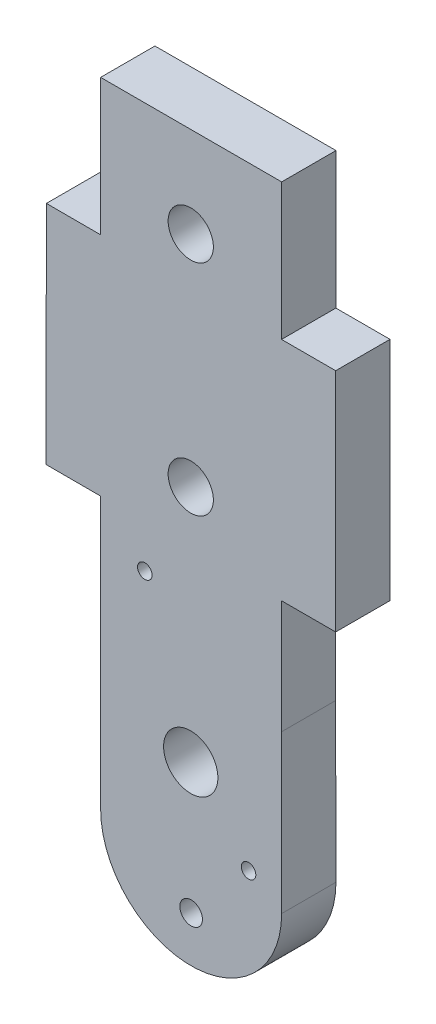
ISO-10303-21;
HEADER;
FILE_DESCRIPTION(('STEP AP214'),'2;1');
FILE_NAME('part.step','',(''),(''),'','','');
FILE_SCHEMA(('AUTOMOTIVE_DESIGN { 1 0 10303 214 1 1 1 1 }'));
ENDSEC;
DATA;
#1=APPLICATION_CONTEXT('core data for automotive mechanical design processes');
#2=APPLICATION_PROTOCOL_DEFINITION('international standard','automotive_design',2000,#1);
#3=PRODUCT_CONTEXT('',#1,'mechanical');
#4=PRODUCT('Part','Part','',(#3));
#5=PRODUCT_RELATED_PRODUCT_CATEGORY('part','',(#4));
#6=PRODUCT_DEFINITION_FORMATION('','',#4);
#7=PRODUCT_DEFINITION_CONTEXT('part definition',#1,'design');
#8=PRODUCT_DEFINITION('design','',#6,#7);
#9=PRODUCT_DEFINITION_SHAPE('','',#8);
#10=(LENGTH_UNIT() NAMED_UNIT(*) SI_UNIT(.MILLI.,.METRE.));
#11=(NAMED_UNIT(*) PLANE_ANGLE_UNIT() SI_UNIT($,.RADIAN.));
#12=(NAMED_UNIT(*) SI_UNIT($,.STERADIAN.) SOLID_ANGLE_UNIT());
#13=UNCERTAINTY_MEASURE_WITH_UNIT(LENGTH_MEASURE(1.E-05),#10,'distance_accuracy_value','');
#14=(GEOMETRIC_REPRESENTATION_CONTEXT(3) GLOBAL_UNCERTAINTY_ASSIGNED_CONTEXT((#13)) GLOBAL_UNIT_ASSIGNED_CONTEXT((#10,
#11,#12)) REPRESENTATION_CONTEXT('',''));
#15=CARTESIAN_POINT('',(0.,0.,0.));
#16=DIRECTION('',(0.,0.,1.));
#17=DIRECTION('',(1.,0.,0.));
#18=AXIS2_PLACEMENT_3D('',#15,#16,#17);
#19=CARTESIAN_POINT('',(217.342156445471,-312.606770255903,6.));
#20=DIRECTION('',(1.,0.,0.));
#21=DIRECTION('',(0.,1.,0.));
#22=AXIS2_PLACEMENT_3D('',#19,#20,#21);
#23=PLANE('',#22);
#24=DIRECTION('',(0.,-1.,0.));
#25=VECTOR('',#24,1.);
#26=CARTESIAN_POINT('',(217.342156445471,-312.606770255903,0.));
#27=LINE('',#26,#25);
#28=CARTESIAN_POINT('',(217.342156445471,-242.033196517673,0.));
#29=VERTEX_POINT('',#28);
#30=CARTESIAN_POINT('',(217.342156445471,-271.971337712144,0.));
#31=VERTEX_POINT('',#30);
#32=EDGE_CURVE('E183',#29,#31,#27,.T.);
#33=ORIENTED_EDGE('',*,*,#32,.T.);
#34=DIRECTION('',(0.,0.,-1.));
#35=VECTOR('',#34,1.);
#36=CARTESIAN_POINT('',(217.342156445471,-271.971337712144,6.));
#37=LINE('',#36,#35);
#38=CARTESIAN_POINT('',(217.342156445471,-271.971337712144,6.));
#39=VERTEX_POINT('',#38);
#40=EDGE_CURVE('E11',#39,#31,#37,.T.);
#41=ORIENTED_EDGE('',*,*,#40,.F.);
#42=DIRECTION('',(0.,-1.,0.));
#43=VECTOR('',#42,1.);
#44=CARTESIAN_POINT('',(217.342156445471,-312.606770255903,6.));
#45=LINE('',#44,#43);
#46=CARTESIAN_POINT('',(217.342156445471,-242.033196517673,6.));
#47=VERTEX_POINT('',#46);
#48=EDGE_CURVE('E268',#47,#39,#45,.T.);
#49=ORIENTED_EDGE('',*,*,#48,.F.);
#50=DIRECTION('',(0.,0.,-1.));
#51=VECTOR('',#50,1.);
#52=CARTESIAN_POINT('',(217.342156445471,-242.033196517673,6.));
#53=LINE('',#52,#51);
#54=EDGE_CURVE('E169',#47,#29,#53,.T.);
#55=ORIENTED_EDGE('',*,*,#54,.T.);
#56=EDGE_LOOP('',(#33,#41,#49,#55));
#57=FACE_BOUND('',#56,.T.);
#58=ADVANCED_FACE('F34',(#57),#23,.F.);
#59=CARTESIAN_POINT('',(227.342156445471,-271.971337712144,6.));
#60=DIRECTION('',(0.,0.,-1.));
#61=DIRECTION('',(-1.,0.,0.));
#62=AXIS2_PLACEMENT_3D('',#59,#60,#61);
#63=CYLINDRICAL_SURFACE('',#62,10.);
#64=CARTESIAN_POINT('',(227.342156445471,-271.971337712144,0.));
#65=DIRECTION('',(0.,0.,1.));
#66=DIRECTION('',(1.,0.,0.));
#67=AXIS2_PLACEMENT_3D('',#64,#65,#66);
#68=CIRCLE('',#67,10.);
#69=CARTESIAN_POINT('',(237.342156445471,-271.971337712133,0.));
#70=VERTEX_POINT('',#69);
#71=EDGE_CURVE('E186',#31,#70,#68,.T.);
#72=ORIENTED_EDGE('',*,*,#71,.T.);
#73=DIRECTION('',(0.,0.,-1.));
#74=VECTOR('',#73,1.);
#75=CARTESIAN_POINT('',(237.342156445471,-271.971337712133,6.));
#76=LINE('',#75,#74);
#77=CARTESIAN_POINT('',(237.342156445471,-271.971337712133,6.));
#78=VERTEX_POINT('',#77);
#79=EDGE_CURVE('E43',#78,#70,#76,.T.);
#80=ORIENTED_EDGE('',*,*,#79,.F.);
#81=CARTESIAN_POINT('',(227.342156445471,-271.971337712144,6.));
#82=DIRECTION('',(0.,0.,1.));
#83=DIRECTION('',(1.,0.,0.));
#84=AXIS2_PLACEMENT_3D('',#81,#82,#83);
#85=CIRCLE('',#84,10.);
#86=EDGE_CURVE('E111',#39,#78,#85,.T.);
#87=ORIENTED_EDGE('',*,*,#86,.F.);
#88=ORIENTED_EDGE('',*,*,#40,.T.);
#89=EDGE_LOOP('',(#72,#80,#87,#88));
#90=FACE_BOUND('',#89,.T.);
#91=ADVANCED_FACE('F250',(#90),#63,.T.);
#92=CARTESIAN_POINT('',(237.444826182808,-312.581228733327,6.));
#93=DIRECTION('',(0.999996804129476,0.00252818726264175,0.));
#94=DIRECTION('',(-0.00252818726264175,0.999996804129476,0.));
#95=AXIS2_PLACEMENT_3D('',#92,#93,#94);
#96=PLANE('',#95);
#97=DIRECTION('',(0.00252818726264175,-0.999996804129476,0.));
#98=VECTOR('',#97,1.);
#99=CARTESIAN_POINT('',(237.444826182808,-312.581228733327,0.));
#100=LINE('',#99,#98);
#101=CARTESIAN_POINT('',(237.298280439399,-254.616663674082,0.));
#102=VERTEX_POINT('',#101);
#103=EDGE_CURVE('E189',#102,#70,#100,.T.);
#104=ORIENTED_EDGE('',*,*,#103,.F.);
#105=DIRECTION('',(0.,0.,-1.));
#106=VECTOR('',#105,1.);
#107=CARTESIAN_POINT('',(237.298280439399,-254.616663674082,6.));
#108=LINE('',#107,#106);
#109=CARTESIAN_POINT('',(237.298280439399,-254.616663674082,6.));
#110=VERTEX_POINT('',#109);
#111=EDGE_CURVE('E243',#110,#102,#108,.T.);
#112=ORIENTED_EDGE('',*,*,#111,.F.);
#113=DIRECTION('',(0.00252818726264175,-0.999996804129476,0.));
#114=VECTOR('',#113,1.);
#115=CARTESIAN_POINT('',(237.444826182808,-312.581228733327,6.));
#116=LINE('',#115,#114);
#117=EDGE_CURVE('E249',#110,#78,#116,.T.);
#118=ORIENTED_EDGE('',*,*,#117,.T.);
#119=ORIENTED_EDGE('',*,*,#79,.T.);
#120=EDGE_LOOP('',(#104,#112,#118,#119));
#121=FACE_BOUND('',#120,.T.);
#122=ADVANCED_FACE('F247',(#121),#96,.T.);
#123=CARTESIAN_POINT('',(237.249943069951,-312.615027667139,6.));
#124=DIRECTION('',(0.999999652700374,-0.000833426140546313,0.));
#125=DIRECTION('',(0.000833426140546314,0.999999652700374,0.));
#126=AXIS2_PLACEMENT_3D('',#123,#124,#125);
#127=PLANE('',#126);
#128=DIRECTION('',(-0.000833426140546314,-0.999999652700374,0.));
#129=VECTOR('',#128,1.);
#130=CARTESIAN_POINT('',(237.249943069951,-312.615027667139,0.));
#131=LINE('',#130,#129);
#132=CARTESIAN_POINT('',(237.308753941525,-242.049865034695,0.));
#133=VERTEX_POINT('',#132);
#134=EDGE_CURVE('E192',#133,#102,#131,.T.);
#135=ORIENTED_EDGE('',*,*,#134,.F.);
#136=DIRECTION('',(0.,0.,-1.));
#137=VECTOR('',#136,1.);
#138=CARTESIAN_POINT('',(237.308753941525,-242.049865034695,6.));
#139=LINE('',#138,#137);
#140=CARTESIAN_POINT('',(237.308753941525,-242.049865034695,6.));
#141=VERTEX_POINT('',#140);
#142=EDGE_CURVE('E241',#141,#133,#139,.T.);
#143=ORIENTED_EDGE('',*,*,#142,.F.);
#144=DIRECTION('',(-0.000833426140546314,-0.999999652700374,0.));
#145=VECTOR('',#144,1.);
#146=CARTESIAN_POINT('',(237.249943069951,-312.615027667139,6.));
#147=LINE('',#146,#145);
#148=EDGE_CURVE('E264',#141,#110,#147,.T.);
#149=ORIENTED_EDGE('',*,*,#148,.T.);
#150=ORIENTED_EDGE('',*,*,#111,.T.);
#151=EDGE_LOOP('',(#135,#143,#149,#150));
#152=FACE_BOUND('',#151,.T.);
#153=ADVANCED_FACE('F260',(#152),#127,.T.);
#154=CARTESIAN_POINT('',(227.342156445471,-242.049865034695,6.));
#155=DIRECTION('',(0.,1.,0.));
#156=DIRECTION('',(0.,0.,1.));
#157=AXIS2_PLACEMENT_3D('',#154,#155,#156);
#158=PLANE('',#157);
#159=DIRECTION('',(1.,0.,0.));
#160=VECTOR('',#159,1.);
#161=CARTESIAN_POINT('',(227.342156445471,-242.049865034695,0.));
#162=LINE('',#161,#160);
#163=CARTESIAN_POINT('',(243.308753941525,-242.049865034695,0.));
#164=VERTEX_POINT('',#163);
#165=EDGE_CURVE('E195',#133,#164,#162,.T.);
#166=ORIENTED_EDGE('',*,*,#165,.T.);
#167=DIRECTION('',(0.,0.,-1.));
#168=VECTOR('',#167,1.);
#169=CARTESIAN_POINT('',(243.308753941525,-242.049865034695,6.));
#170=LINE('',#169,#168);
#171=CARTESIAN_POINT('',(243.308753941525,-242.049865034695,6.));
#172=VERTEX_POINT('',#171);
#173=EDGE_CURVE('E238',#172,#164,#170,.T.);
#174=ORIENTED_EDGE('',*,*,#173,.F.);
#175=DIRECTION('',(1.,0.,0.));
#176=VECTOR('',#175,1.);
#177=CARTESIAN_POINT('',(227.342156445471,-242.049865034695,6.));
#178=LINE('',#177,#176);
#179=EDGE_CURVE('E266',#141,#172,#178,.T.);
#180=ORIENTED_EDGE('',*,*,#179,.F.);
#181=ORIENTED_EDGE('',*,*,#142,.T.);
#182=EDGE_LOOP('',(#166,#174,#180,#181));
#183=FACE_BOUND('',#182,.T.);
#184=ADVANCED_FACE('F506',(#183),#158,.F.);
#185=CARTESIAN_POINT('',(243.308753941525,-312.606770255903,6.));
#186=DIRECTION('',(-1.,0.,0.));
#187=DIRECTION('',(0.,0.,1.));
#188=AXIS2_PLACEMENT_3D('',#185,#186,#187);
#189=PLANE('',#188);
#190=DIRECTION('',(0.,1.,0.));
#191=VECTOR('',#190,1.);
#192=CARTESIAN_POINT('',(243.308753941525,-312.606770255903,0.));
#193=LINE('',#192,#191);
#194=CARTESIAN_POINT('',(243.308753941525,-217.049865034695,0.));
#195=VERTEX_POINT('',#194);
#196=EDGE_CURVE('E197',#164,#195,#193,.T.);
#197=ORIENTED_EDGE('',*,*,#196,.T.);
#198=DIRECTION('',(0.,0.,-1.));
#199=VECTOR('',#198,1.);
#200=CARTESIAN_POINT('',(243.308753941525,-217.049865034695,6.));
#201=LINE('',#200,#199);
#202=CARTESIAN_POINT('',(243.308753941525,-217.049865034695,6.));
#203=VERTEX_POINT('',#202);
#204=EDGE_CURVE('E235',#203,#195,#201,.T.);
#205=ORIENTED_EDGE('',*,*,#204,.F.);
#206=DIRECTION('',(0.,1.,0.));
#207=VECTOR('',#206,1.);
#208=CARTESIAN_POINT('',(243.308753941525,-312.606770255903,6.));
#209=LINE('',#208,#207);
#210=EDGE_CURVE('E273',#172,#203,#209,.T.);
#211=ORIENTED_EDGE('',*,*,#210,.F.);
#212=ORIENTED_EDGE('',*,*,#173,.T.);
#213=EDGE_LOOP('',(#197,#205,#211,#212));
#214=FACE_BOUND('',#213,.T.);
#215=ADVANCED_FACE('F496',(#214),#189,.F.);
#216=CARTESIAN_POINT('',(227.342156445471,-217.049865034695,6.));
#217=DIRECTION('',(0.,-1.,0.));
#218=DIRECTION('',(0.,0.,-1.));
#219=AXIS2_PLACEMENT_3D('',#216,#217,#218);
#220=PLANE('',#219);
#221=DIRECTION('',(-1.,0.,0.));
#222=VECTOR('',#221,1.);
#223=CARTESIAN_POINT('',(227.342156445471,-217.049865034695,0.));
#224=LINE('',#223,#222);
#225=CARTESIAN_POINT('',(237.329589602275,-217.049865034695,0.));
#226=VERTEX_POINT('',#225);
#227=EDGE_CURVE('E199',#195,#226,#224,.T.);
#228=ORIENTED_EDGE('',*,*,#227,.T.);
#229=DIRECTION('',(0.,0.,-1.));
#230=VECTOR('',#229,1.);
#231=CARTESIAN_POINT('',(237.329589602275,-217.049865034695,6.));
#232=LINE('',#231,#230);
#233=CARTESIAN_POINT('',(237.329589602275,-217.049865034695,6.));
#234=VERTEX_POINT('',#233);
#235=EDGE_CURVE('E233',#234,#226,#232,.T.);
#236=ORIENTED_EDGE('',*,*,#235,.F.);
#237=DIRECTION('',(-1.,0.,0.));
#238=VECTOR('',#237,1.);
#239=CARTESIAN_POINT('',(227.342156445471,-217.049865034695,6.));
#240=LINE('',#239,#238);
#241=EDGE_CURVE('E275',#203,#234,#240,.T.);
#242=ORIENTED_EDGE('',*,*,#241,.F.);
#243=ORIENTED_EDGE('',*,*,#204,.T.);
#244=EDGE_LOOP('',(#228,#236,#242,#243));
#245=FACE_BOUND('',#244,.T.);
#246=ADVANCED_FACE('F486',(#245),#220,.F.);
#247=CARTESIAN_POINT('',(237.249943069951,-312.615027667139,6.));
#248=DIRECTION('',(0.999999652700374,-0.000833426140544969,0.));
#249=DIRECTION('',(0.00083342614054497,0.999999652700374,0.));
#250=AXIS2_PLACEMENT_3D('',#247,#248,#249);
#251=PLANE('',#250);
#252=DIRECTION('',(-0.000833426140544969,-0.999999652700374,0.));
#253=VECTOR('',#252,1.);
#254=CARTESIAN_POINT('',(237.249943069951,-312.615027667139,0.));
#255=LINE('',#254,#253);
#256=CARTESIAN_POINT('',(237.342156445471,-201.971337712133,0.));
#257=VERTEX_POINT('',#256);
#258=EDGE_CURVE('E202',#257,#226,#255,.T.);
#259=ORIENTED_EDGE('',*,*,#258,.F.);
#260=DIRECTION('',(0.,0.,-1.));
#261=VECTOR('',#260,1.);
#262=CARTESIAN_POINT('',(237.342156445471,-201.971337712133,6.));
#263=LINE('',#262,#261);
#264=CARTESIAN_POINT('',(237.342156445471,-201.971337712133,6.));
#265=VERTEX_POINT('',#264);
#266=EDGE_CURVE('E231',#265,#257,#263,.T.);
#267=ORIENTED_EDGE('',*,*,#266,.F.);
#268=DIRECTION('',(-0.000833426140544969,-0.999999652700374,0.));
#269=VECTOR('',#268,1.);
#270=CARTESIAN_POINT('',(237.249943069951,-312.615027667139,6.));
#271=LINE('',#270,#269);
#272=EDGE_CURVE('E277',#265,#234,#271,.T.);
#273=ORIENTED_EDGE('',*,*,#272,.T.);
#274=ORIENTED_EDGE('',*,*,#235,.T.);
#275=EDGE_LOOP('',(#259,#267,#273,#274));
#276=FACE_BOUND('',#275,.T.);
#277=ADVANCED_FACE('F476',(#276),#251,.T.);
#278=CARTESIAN_POINT('',(227.342156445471,-201.971337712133,6.));
#279=DIRECTION('',(0.,1.,0.));
#280=DIRECTION('',(0.,0.,1.));
#281=AXIS2_PLACEMENT_3D('',#278,#279,#280);
#282=PLANE('',#281);
#283=DIRECTION('',(1.,0.,0.));
#284=VECTOR('',#283,1.);
#285=CARTESIAN_POINT('',(227.342156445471,-201.971337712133,0.));
#286=LINE('',#285,#284);
#287=CARTESIAN_POINT('',(217.342156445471,-201.971337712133,0.));
#288=VERTEX_POINT('',#287);
#289=EDGE_CURVE('E205',#288,#257,#286,.T.);
#290=ORIENTED_EDGE('',*,*,#289,.F.);
#291=DIRECTION('',(0.,0.,-1.));
#292=VECTOR('',#291,1.);
#293=CARTESIAN_POINT('',(217.342156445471,-201.971337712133,6.));
#294=LINE('',#293,#292);
#295=CARTESIAN_POINT('',(217.342156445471,-201.971337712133,6.));
#296=VERTEX_POINT('',#295);
#297=EDGE_CURVE('E229',#296,#288,#294,.T.);
#298=ORIENTED_EDGE('',*,*,#297,.F.);
#299=DIRECTION('',(1.,0.,0.));
#300=VECTOR('',#299,1.);
#301=CARTESIAN_POINT('',(227.342156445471,-201.971337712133,6.));
#302=LINE('',#301,#300);
#303=EDGE_CURVE('E280',#296,#265,#302,.T.);
#304=ORIENTED_EDGE('',*,*,#303,.T.);
#305=ORIENTED_EDGE('',*,*,#266,.T.);
#306=EDGE_LOOP('',(#290,#298,#304,#305));
#307=FACE_BOUND('',#306,.T.);
#308=ADVANCED_FACE('F465',(#307),#282,.T.);
#309=CARTESIAN_POINT('',(217.342156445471,-312.606770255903,6.));
#310=DIRECTION('',(-1.,0.,0.));
#311=DIRECTION('',(0.,-1.,0.));
#312=AXIS2_PLACEMENT_3D('',#309,#310,#311);
#313=PLANE('',#312);
#314=DIRECTION('',(0.,1.,0.));
#315=VECTOR('',#314,1.);
#316=CARTESIAN_POINT('',(217.342156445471,-312.606770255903,0.));
#317=LINE('',#316,#315);
#318=CARTESIAN_POINT('',(217.342156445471,-217.033196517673,0.));
#319=VERTEX_POINT('',#318);
#320=EDGE_CURVE('E208',#319,#288,#317,.T.);
#321=ORIENTED_EDGE('',*,*,#320,.F.);
#322=DIRECTION('',(0.,0.,-1.));
#323=VECTOR('',#322,1.);
#324=CARTESIAN_POINT('',(217.342156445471,-217.033196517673,6.));
#325=LINE('',#324,#323);
#326=CARTESIAN_POINT('',(217.342156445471,-217.033196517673,6.));
#327=VERTEX_POINT('',#326);
#328=EDGE_CURVE('E227',#327,#319,#325,.T.);
#329=ORIENTED_EDGE('',*,*,#328,.F.);
#330=DIRECTION('',(0.,1.,0.));
#331=VECTOR('',#330,1.);
#332=CARTESIAN_POINT('',(217.342156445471,-312.606770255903,6.));
#333=LINE('',#332,#331);
#334=EDGE_CURVE('E283',#327,#296,#333,.T.);
#335=ORIENTED_EDGE('',*,*,#334,.T.);
#336=ORIENTED_EDGE('',*,*,#297,.T.);
#337=EDGE_LOOP('',(#321,#329,#335,#336));
#338=FACE_BOUND('',#337,.T.);
#339=ADVANCED_FACE('F455',(#338),#313,.T.);
#340=CARTESIAN_POINT('',(227.342156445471,-217.033196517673,6.));
#341=DIRECTION('',(0.,1.,0.));
#342=DIRECTION('',(0.,0.,1.));
#343=AXIS2_PLACEMENT_3D('',#340,#341,#342);
#344=PLANE('',#343);
#345=DIRECTION('',(1.,0.,0.));
#346=VECTOR('',#345,1.);
#347=CARTESIAN_POINT('',(227.342156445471,-217.033196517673,0.));
#348=LINE('',#347,#346);
#349=CARTESIAN_POINT('',(217.329603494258,-217.033196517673,0.));
#350=VERTEX_POINT('',#349);
#351=EDGE_CURVE('E211',#350,#319,#348,.T.);
#352=ORIENTED_EDGE('',*,*,#351,.F.);
#353=DIRECTION('',(0.,0.,-1.));
#354=VECTOR('',#353,1.);
#355=CARTESIAN_POINT('',(217.329603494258,-217.033196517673,6.));
#356=LINE('',#355,#354);
#357=CARTESIAN_POINT('',(217.329603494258,-217.033196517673,6.));
#358=VERTEX_POINT('',#357);
#359=EDGE_CURVE('E225',#358,#350,#356,.T.);
#360=ORIENTED_EDGE('',*,*,#359,.F.);
#361=DIRECTION('',(1.,0.,0.));
#362=VECTOR('',#361,1.);
#363=CARTESIAN_POINT('',(227.342156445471,-217.033196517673,6.));
#364=LINE('',#363,#362);
#365=EDGE_CURVE('E286',#358,#327,#364,.T.);
#366=ORIENTED_EDGE('',*,*,#365,.T.);
#367=ORIENTED_EDGE('',*,*,#328,.T.);
#368=EDGE_LOOP('',(#352,#360,#366,#367));
#369=FACE_BOUND('',#368,.T.);
#370=ADVANCED_FACE('F446',(#369),#344,.T.);
#371=CARTESIAN_POINT('',(227.50143537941,-217.050151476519,6.));
#372=DIRECTION('',(0.00166685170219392,0.999998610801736,0.));
#373=DIRECTION('',(-0.999998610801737,0.00166685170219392,0.));
#374=AXIS2_PLACEMENT_3D('',#371,#372,#373);
#375=PLANE('',#374);
#376=DIRECTION('',(0.999998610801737,-0.00166685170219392,0.));
#377=VECTOR('',#376,1.);
#378=CARTESIAN_POINT('',(227.50143537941,-217.050151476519,0.));
#379=LINE('',#378,#377);
#380=CARTESIAN_POINT('',(211.350447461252,-217.023230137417,0.));
#381=VERTEX_POINT('',#380);
#382=EDGE_CURVE('E214',#381,#350,#379,.T.);
#383=ORIENTED_EDGE('',*,*,#382,.F.);
#384=DIRECTION('',(0.,0.,-1.));
#385=VECTOR('',#384,1.);
#386=CARTESIAN_POINT('',(211.350447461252,-217.023230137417,6.));
#387=LINE('',#386,#385);
#388=CARTESIAN_POINT('',(211.350447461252,-217.023230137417,6.));
#389=VERTEX_POINT('',#388);
#390=EDGE_CURVE('E157',#389,#381,#387,.T.);
#391=ORIENTED_EDGE('',*,*,#390,.F.);
#392=DIRECTION('',(0.999998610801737,-0.00166685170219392,0.));
#393=VECTOR('',#392,1.);
#394=CARTESIAN_POINT('',(227.50143537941,-217.050151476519,6.));
#395=LINE('',#394,#393);
#396=EDGE_CURVE('E165',#389,#358,#395,.T.);
#397=ORIENTED_EDGE('',*,*,#396,.T.);
#398=ORIENTED_EDGE('',*,*,#359,.T.);
#399=EDGE_LOOP('',(#383,#391,#397,#398));
#400=FACE_BOUND('',#399,.T.);
#401=ADVANCED_FACE('F290',(#400),#375,.T.);
#402=CARTESIAN_POINT('',(211.191168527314,-312.579848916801,6.));
#403=DIRECTION('',(-0.999998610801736,0.00166685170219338,0.));
#404=DIRECTION('',(-0.00166685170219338,-0.999998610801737,0.));
#405=AXIS2_PLACEMENT_3D('',#402,#403,#404);
#406=PLANE('',#405);
#407=DIRECTION('',(0.00166685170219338,0.999998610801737,0.));
#408=VECTOR('',#407,1.);
#409=CARTESIAN_POINT('',(211.191168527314,-312.579848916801,0.));
#410=LINE('',#409,#408);
#411=CARTESIAN_POINT('',(211.308776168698,-242.02319540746,0.));
#412=VERTEX_POINT('',#411);
#413=EDGE_CURVE('E152',#412,#381,#410,.T.);
#414=ORIENTED_EDGE('',*,*,#413,.F.);
#415=DIRECTION('',(0.,0.,-1.));
#416=VECTOR('',#415,1.);
#417=CARTESIAN_POINT('',(211.308776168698,-242.02319540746,6.));
#418=LINE('',#417,#416);
#419=CARTESIAN_POINT('',(211.308776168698,-242.02319540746,6.));
#420=VERTEX_POINT('',#419);
#421=EDGE_CURVE('E147',#420,#412,#418,.T.);
#422=ORIENTED_EDGE('',*,*,#421,.F.);
#423=DIRECTION('',(0.00166685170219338,0.999998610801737,0.));
#424=VECTOR('',#423,1.);
#425=CARTESIAN_POINT('',(211.191168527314,-312.579848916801,6.));
#426=LINE('',#425,#424);
#427=EDGE_CURVE('E150',#420,#389,#426,.T.);
#428=ORIENTED_EDGE('',*,*,#427,.T.);
#429=ORIENTED_EDGE('',*,*,#390,.T.);
#430=EDGE_LOOP('',(#414,#422,#428,#429));
#431=FACE_BOUND('',#430,.T.);
#432=ADVANCED_FACE('F149',(#431),#406,.T.);
#433=CARTESIAN_POINT('',(227.459764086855,-242.050116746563,6.));
#434=DIRECTION('',(-0.00166685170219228,-0.999998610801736,0.));
#435=DIRECTION('',(0.999998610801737,-0.00166685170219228,0.));
#436=AXIS2_PLACEMENT_3D('',#433,#434,#435);
#437=PLANE('',#436);
#438=DIRECTION('',(-0.999998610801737,0.00166685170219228,0.));
#439=VECTOR('',#438,1.);
#440=CARTESIAN_POINT('',(227.459764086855,-242.050116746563,0.));
#441=LINE('',#440,#439);
#442=CARTESIAN_POINT('',(217.308767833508,-242.033196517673,0.));
#443=VERTEX_POINT('',#442);
#444=EDGE_CURVE('E218',#443,#412,#441,.T.);
#445=ORIENTED_EDGE('',*,*,#444,.F.);
#446=DIRECTION('',(0.,0.,-1.));
#447=VECTOR('',#446,1.);
#448=CARTESIAN_POINT('',(217.308767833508,-242.033196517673,6.));
#449=LINE('',#448,#447);
#450=CARTESIAN_POINT('',(217.308767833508,-242.033196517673,6.));
#451=VERTEX_POINT('',#450);
#452=EDGE_CURVE('E100',#451,#443,#449,.T.);
#453=ORIENTED_EDGE('',*,*,#452,.F.);
#454=DIRECTION('',(-0.999998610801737,0.00166685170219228,0.));
#455=VECTOR('',#454,1.);
#456=CARTESIAN_POINT('',(227.459764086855,-242.050116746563,6.));
#457=LINE('',#456,#455);
#458=EDGE_CURVE('E162',#451,#420,#457,.T.);
#459=ORIENTED_EDGE('',*,*,#458,.T.);
#460=ORIENTED_EDGE('',*,*,#421,.T.);
#461=EDGE_LOOP('',(#445,#453,#459,#460));
#462=FACE_BOUND('',#461,.T.);
#463=ADVANCED_FACE('F167',(#462),#437,.T.);
#464=CARTESIAN_POINT('',(227.342156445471,-276.905454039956,6.));
#465=DIRECTION('',(0.,0.,-1.));
#466=DIRECTION('',(-1.,0.,0.));
#467=AXIS2_PLACEMENT_3D('',#464,#465,#466);
#468=CYLINDRICAL_SURFACE('',#467,1.25000000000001);
#469=CARTESIAN_POINT('',(227.342156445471,-276.905454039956,6.));
#470=DIRECTION('',(0.,0.,1.));
#471=DIRECTION('',(1.,0.,0.));
#472=AXIS2_PLACEMENT_3D('',#469,#470,#471);
#473=CIRCLE('',#472,1.25000000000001);
#474=CARTESIAN_POINT('',(228.592156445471,-276.905454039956,6.));
#475=VERTEX_POINT('',#474);
#476=EDGE_CURVE('E374',#475,#475,#473,.T.);
#477=ORIENTED_EDGE('',*,*,#476,.T.);
#478=EDGE_LOOP('',(#477));
#479=FACE_BOUND('',#478,.T.);
#480=CARTESIAN_POINT('',(227.342156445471,-276.905454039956,0.));
#481=DIRECTION('',(0.,0.,1.));
#482=DIRECTION('',(1.,0.,0.));
#483=AXIS2_PLACEMENT_3D('',#480,#481,#482);
#484=CIRCLE('',#483,1.25000000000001);
#485=CARTESIAN_POINT('',(228.592156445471,-276.905454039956,0.));
#486=VERTEX_POINT('',#485);
#487=EDGE_CURVE('E180',#486,#486,#484,.T.);
#488=ORIENTED_EDGE('',*,*,#487,.F.);
#489=EDGE_LOOP('',(#488));
#490=FACE_BOUND('',#489,.T.);
#491=ADVANCED_FACE('F315',(#479,#490),#468,.F.);
#492=CARTESIAN_POINT('',(227.298280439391,-211.971337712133,6.));
#493=DIRECTION('',(0.,0.,-1.));
#494=DIRECTION('',(-1.,0.,0.));
#495=AXIS2_PLACEMENT_3D('',#492,#493,#494);
#496=CYLINDRICAL_SURFACE('',#495,2.5);
#497=CARTESIAN_POINT('',(227.298280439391,-211.971337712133,6.));
#498=DIRECTION('',(0.,0.,1.));
#499=DIRECTION('',(1.,0.,0.));
#500=AXIS2_PLACEMENT_3D('',#497,#498,#499);
#501=CIRCLE('',#500,2.5);
#502=CARTESIAN_POINT('',(229.798280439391,-211.971337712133,6.));
#503=VERTEX_POINT('',#502);
#504=EDGE_CURVE('E325',#503,#503,#501,.T.);
#505=ORIENTED_EDGE('',*,*,#504,.T.);
#506=EDGE_LOOP('',(#505));
#507=FACE_BOUND('',#506,.T.);
#508=CARTESIAN_POINT('',(227.298280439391,-211.971337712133,0.));
#509=DIRECTION('',(0.,0.,1.));
#510=DIRECTION('',(1.,0.,0.));
#511=AXIS2_PLACEMENT_3D('',#508,#509,#510);
#512=CIRCLE('',#511,2.5);
#513=CARTESIAN_POINT('',(229.798280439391,-211.971337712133,0.));
#514=VERTEX_POINT('',#513);
#515=EDGE_CURVE('E176',#514,#514,#512,.T.);
#516=ORIENTED_EDGE('',*,*,#515,.F.);
#517=EDGE_LOOP('',(#516));
#518=FACE_BOUND('',#517,.T.);
#519=ADVANCED_FACE('F303',(#507,#518),#496,.F.);
#520=CARTESIAN_POINT('',(227.298280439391,-236.176306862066,6.));
#521=DIRECTION('',(0.,0.,-1.));
#522=DIRECTION('',(-1.,0.,0.));
#523=AXIS2_PLACEMENT_3D('',#520,#521,#522);
#524=CYLINDRICAL_SURFACE('',#523,2.5);
#525=CARTESIAN_POINT('',(227.298280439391,-236.176306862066,6.));
#526=DIRECTION('',(0.,0.,1.));
#527=DIRECTION('',(1.,0.,0.));
#528=AXIS2_PLACEMENT_3D('',#525,#526,#527);
#529=CIRCLE('',#528,2.5);
#530=CARTESIAN_POINT('',(229.798280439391,-236.176306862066,6.));
#531=VERTEX_POINT('',#530);
#532=EDGE_CURVE('E221',#531,#531,#529,.T.);
#533=ORIENTED_EDGE('',*,*,#532,.T.);
#534=EDGE_LOOP('',(#533));
#535=FACE_BOUND('',#534,.T.);
#536=CARTESIAN_POINT('',(227.298280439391,-236.176306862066,0.));
#537=DIRECTION('',(0.,0.,1.));
#538=DIRECTION('',(1.,0.,0.));
#539=AXIS2_PLACEMENT_3D('',#536,#537,#538);
#540=CIRCLE('',#539,2.5);
#541=CARTESIAN_POINT('',(229.798280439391,-236.176306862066,0.));
#542=VERTEX_POINT('',#541);
#543=EDGE_CURVE('E173',#542,#542,#540,.T.);
#544=ORIENTED_EDGE('',*,*,#543,.F.);
#545=EDGE_LOOP('',(#544));
#546=FACE_BOUND('',#545,.T.);
#547=ADVANCED_FACE('F36',(#535,#546),#524,.F.);
#548=CARTESIAN_POINT('',(227.342156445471,-242.033196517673,6.));
#549=DIRECTION('',(0.,1.,0.));
#550=DIRECTION('',(0.,0.,1.));
#551=AXIS2_PLACEMENT_3D('',#548,#549,#550);
#552=PLANE('',#551);
#553=DIRECTION('',(1.,0.,0.));
#554=VECTOR('',#553,1.);
#555=CARTESIAN_POINT('',(227.342156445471,-242.033196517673,0.));
#556=LINE('',#555,#554);
#557=EDGE_CURVE('E103',#443,#29,#556,.T.);
#558=ORIENTED_EDGE('',*,*,#557,.T.);
#559=ORIENTED_EDGE('',*,*,#54,.F.);
#560=DIRECTION('',(1.,0.,0.));
#561=VECTOR('',#560,1.);
#562=CARTESIAN_POINT('',(227.342156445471,-242.033196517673,6.));
#563=LINE('',#562,#561);
#564=EDGE_CURVE('E51',#451,#47,#563,.T.);
#565=ORIENTED_EDGE('',*,*,#564,.F.);
#566=ORIENTED_EDGE('',*,*,#452,.T.);
#567=EDGE_LOOP('',(#558,#559,#565,#566));
#568=FACE_BOUND('',#567,.T.);
#569=ADVANCED_FACE('F294',(#568),#552,.F.);
#570=CARTESIAN_POINT('',(227.342156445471,-312.606770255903,6.));
#571=DIRECTION('',(0.,0.,1.));
#572=DIRECTION('',(1.,0.,0.));
#573=AXIS2_PLACEMENT_3D('',#570,#571,#572);
#574=PLANE('',#573);
#575=ORIENTED_EDGE('',*,*,#532,.F.);
#576=EDGE_LOOP('',(#575));
#577=FACE_BOUND('',#576,.T.);
#578=ORIENTED_EDGE('',*,*,#504,.F.);
#579=EDGE_LOOP('',(#578));
#580=FACE_BOUND('',#579,.T.);
#581=ORIENTED_EDGE('',*,*,#476,.F.);
#582=EDGE_LOOP('',(#581));
#583=FACE_BOUND('',#582,.T.);
#584=ORIENTED_EDGE('',*,*,#48,.T.);
#585=ORIENTED_EDGE('',*,*,#86,.T.);
#586=ORIENTED_EDGE('',*,*,#117,.F.);
#587=ORIENTED_EDGE('',*,*,#148,.F.);
#588=ORIENTED_EDGE('',*,*,#179,.T.);
#589=ORIENTED_EDGE('',*,*,#210,.T.);
#590=ORIENTED_EDGE('',*,*,#241,.T.);
#591=ORIENTED_EDGE('',*,*,#272,.F.);
#592=ORIENTED_EDGE('',*,*,#303,.F.);
#593=ORIENTED_EDGE('',*,*,#334,.F.);
#594=ORIENTED_EDGE('',*,*,#365,.F.);
#595=ORIENTED_EDGE('',*,*,#396,.F.);
#596=ORIENTED_EDGE('',*,*,#427,.F.);
#597=ORIENTED_EDGE('',*,*,#458,.F.);
#598=ORIENTED_EDGE('',*,*,#564,.T.);
#599=EDGE_LOOP('',(#584,#585,#586,#587,#588,#589,#590,#591,#592,#593,#594,#595,#596,#597,#598));
#600=FACE_BOUND('',#599,.T.);
#601=CARTESIAN_POINT('',(222.224410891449,-246.76384907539,6.));
#602=DIRECTION('',(0.,0.,1.));
#603=DIRECTION('',(1.,0.,0.));
#604=AXIS2_PLACEMENT_3D('',#601,#602,#603);
#605=CIRCLE('',#604,0.799999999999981);
#606=CARTESIAN_POINT('',(223.024410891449,-246.76384907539,6.));
#607=VERTEX_POINT('',#606);
#608=EDGE_CURVE('E364',#607,#607,#605,.T.);
#609=ORIENTED_EDGE('',*,*,#608,.F.);
#610=EDGE_LOOP('',(#609));
#611=FACE_BOUND('',#610,.T.);
#612=CARTESIAN_POINT('',(233.684410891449,-269.702891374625,6.));
#613=DIRECTION('',(0.,0.,1.));
#614=DIRECTION('',(1.,0.,0.));
#615=AXIS2_PLACEMENT_3D('',#612,#613,#614);
#616=CIRCLE('',#615,0.799999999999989);
#617=CARTESIAN_POINT('',(234.484410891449,-269.702891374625,6.));
#618=VERTEX_POINT('',#617);
#619=EDGE_CURVE('E358',#618,#618,#616,.T.);
#620=ORIENTED_EDGE('',*,*,#619,.F.);
#621=EDGE_LOOP('',(#620));
#622=FACE_BOUND('',#621,.T.);
#623=CARTESIAN_POINT('',(227.298280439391,-262.507863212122,6.));
#624=DIRECTION('',(0.,0.,1.));
#625=DIRECTION('',(1.,0.,0.));
#626=AXIS2_PLACEMENT_3D('',#623,#624,#625);
#627=CIRCLE('',#626,2.99999999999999);
#628=CARTESIAN_POINT('',(230.298280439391,-262.507863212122,6.));
#629=VERTEX_POINT('',#628);
#630=EDGE_CURVE('E355',#629,#629,#627,.T.);
#631=ORIENTED_EDGE('',*,*,#630,.F.);
#632=EDGE_LOOP('',(#631));
#633=FACE_BOUND('',#632,.T.);
#634=ADVANCED_FACE('F160',(#577,#580,#583,#600,#611,#622,#633),#574,.T.);
#635=CARTESIAN_POINT('',(227.342156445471,-312.606770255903,0.));
#636=DIRECTION('',(0.,0.,1.));
#637=DIRECTION('',(1.,0.,0.));
#638=AXIS2_PLACEMENT_3D('',#635,#636,#637);
#639=PLANE('',#638);
#640=ORIENTED_EDGE('',*,*,#543,.T.);
#641=EDGE_LOOP('',(#640));
#642=FACE_BOUND('',#641,.T.);
#643=ORIENTED_EDGE('',*,*,#515,.T.);
#644=EDGE_LOOP('',(#643));
#645=FACE_BOUND('',#644,.T.);
#646=ORIENTED_EDGE('',*,*,#487,.T.);
#647=EDGE_LOOP('',(#646));
#648=FACE_BOUND('',#647,.T.);
#649=ORIENTED_EDGE('',*,*,#32,.F.);
#650=ORIENTED_EDGE('',*,*,#557,.F.);
#651=ORIENTED_EDGE('',*,*,#444,.T.);
#652=ORIENTED_EDGE('',*,*,#413,.T.);
#653=ORIENTED_EDGE('',*,*,#382,.T.);
#654=ORIENTED_EDGE('',*,*,#351,.T.);
#655=ORIENTED_EDGE('',*,*,#320,.T.);
#656=ORIENTED_EDGE('',*,*,#289,.T.);
#657=ORIENTED_EDGE('',*,*,#258,.T.);
#658=ORIENTED_EDGE('',*,*,#227,.F.);
#659=ORIENTED_EDGE('',*,*,#196,.F.);
#660=ORIENTED_EDGE('',*,*,#165,.F.);
#661=ORIENTED_EDGE('',*,*,#134,.T.);
#662=ORIENTED_EDGE('',*,*,#103,.T.);
#663=ORIENTED_EDGE('',*,*,#71,.F.);
#664=EDGE_LOOP('',(#649,#650,#651,#652,#653,#654,#655,#656,#657,#658,#659,#660,#661,#662,#663));
#665=FACE_BOUND('',#664,.T.);
#666=CARTESIAN_POINT('',(222.224410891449,-246.76384907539,0.));
#667=DIRECTION('',(0.,0.,1.));
#668=DIRECTION('',(1.,0.,0.));
#669=AXIS2_PLACEMENT_3D('',#666,#667,#668);
#670=CIRCLE('',#669,0.799999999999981);
#671=CARTESIAN_POINT('',(223.024410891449,-246.76384907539,0.));
#672=VERTEX_POINT('',#671);
#673=EDGE_CURVE('E177',#672,#672,#670,.T.);
#674=ORIENTED_EDGE('',*,*,#673,.T.);
#675=EDGE_LOOP('',(#674));
#676=FACE_BOUND('',#675,.T.);
#677=CARTESIAN_POINT('',(233.684410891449,-269.702891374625,0.));
#678=DIRECTION('',(0.,0.,1.));
#679=DIRECTION('',(1.,0.,0.));
#680=AXIS2_PLACEMENT_3D('',#677,#678,#679);
#681=CIRCLE('',#680,0.799999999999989);
#682=CARTESIAN_POINT('',(234.484410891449,-269.702891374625,0.));
#683=VERTEX_POINT('',#682);
#684=EDGE_CURVE('E361',#683,#683,#681,.T.);
#685=ORIENTED_EDGE('',*,*,#684,.T.);
#686=EDGE_LOOP('',(#685));
#687=FACE_BOUND('',#686,.T.);
#688=CARTESIAN_POINT('',(227.298280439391,-262.507863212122,0.));
#689=DIRECTION('',(0.,0.,1.));
#690=DIRECTION('',(1.,0.,0.));
#691=AXIS2_PLACEMENT_3D('',#688,#689,#690);
#692=CIRCLE('',#691,2.99999999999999);
#693=CARTESIAN_POINT('',(230.298280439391,-262.507863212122,0.));
#694=VERTEX_POINT('',#693);
#695=EDGE_CURVE('E352',#694,#694,#692,.T.);
#696=ORIENTED_EDGE('',*,*,#695,.T.);
#697=EDGE_LOOP('',(#696));
#698=FACE_BOUND('',#697,.T.);
#699=ADVANCED_FACE('F254',(#642,#645,#648,#665,#676,#687,#698),#639,.F.);
#700=CARTESIAN_POINT('',(222.224410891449,-246.76384907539,0.));
#701=DIRECTION('',(0.,0.,1.));
#702=DIRECTION('',(1.,0.,0.));
#703=AXIS2_PLACEMENT_3D('',#700,#701,#702);
#704=CYLINDRICAL_SURFACE('',#703,0.799999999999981);
#705=ORIENTED_EDGE('',*,*,#673,.F.);
#706=EDGE_LOOP('',(#705));
#707=FACE_BOUND('',#706,.T.);
#708=ORIENTED_EDGE('',*,*,#608,.T.);
#709=EDGE_LOOP('',(#708));
#710=FACE_BOUND('',#709,.T.);
#711=ADVANCED_FACE('F330',(#707,#710),#704,.F.);
#712=CARTESIAN_POINT('',(233.684410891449,-269.702891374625,0.));
#713=DIRECTION('',(0.,0.,1.));
#714=DIRECTION('',(1.,0.,0.));
#715=AXIS2_PLACEMENT_3D('',#712,#713,#714);
#716=CYLINDRICAL_SURFACE('',#715,0.799999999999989);
#717=ORIENTED_EDGE('',*,*,#684,.F.);
#718=EDGE_LOOP('',(#717));
#719=FACE_BOUND('',#718,.T.);
#720=ORIENTED_EDGE('',*,*,#619,.T.);
#721=EDGE_LOOP('',(#720));
#722=FACE_BOUND('',#721,.T.);
#723=ADVANCED_FACE('F337',(#719,#722),#716,.F.);
#724=CARTESIAN_POINT('',(227.298280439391,-262.507863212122,0.));
#725=DIRECTION('',(0.,0.,1.));
#726=DIRECTION('',(1.,0.,0.));
#727=AXIS2_PLACEMENT_3D('',#724,#725,#726);
#728=CYLINDRICAL_SURFACE('',#727,2.99999999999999);
#729=ORIENTED_EDGE('',*,*,#695,.F.);
#730=EDGE_LOOP('',(#729));
#731=FACE_BOUND('',#730,.T.);
#732=ORIENTED_EDGE('',*,*,#630,.T.);
#733=EDGE_LOOP('',(#732));
#734=FACE_BOUND('',#733,.T.);
#735=ADVANCED_FACE('F343',(#731,#734),#728,.F.);
#736=CLOSED_SHELL('',(#58,#91,#122,#153,#184,#215,#246,#277,#308,#339,#370,#401,#432,#463,#491,
#519,#547,#569,#634,#699,#711,#723,#735));
#737=MANIFOLD_SOLID_BREP('B2',#736);
#738=ADVANCED_BREP_SHAPE_REPRESENTATION('',(#18,#737),#14);
#739=SHAPE_DEFINITION_REPRESENTATION(#9,#738);
ENDSEC;
END-ISO-10303-21;
